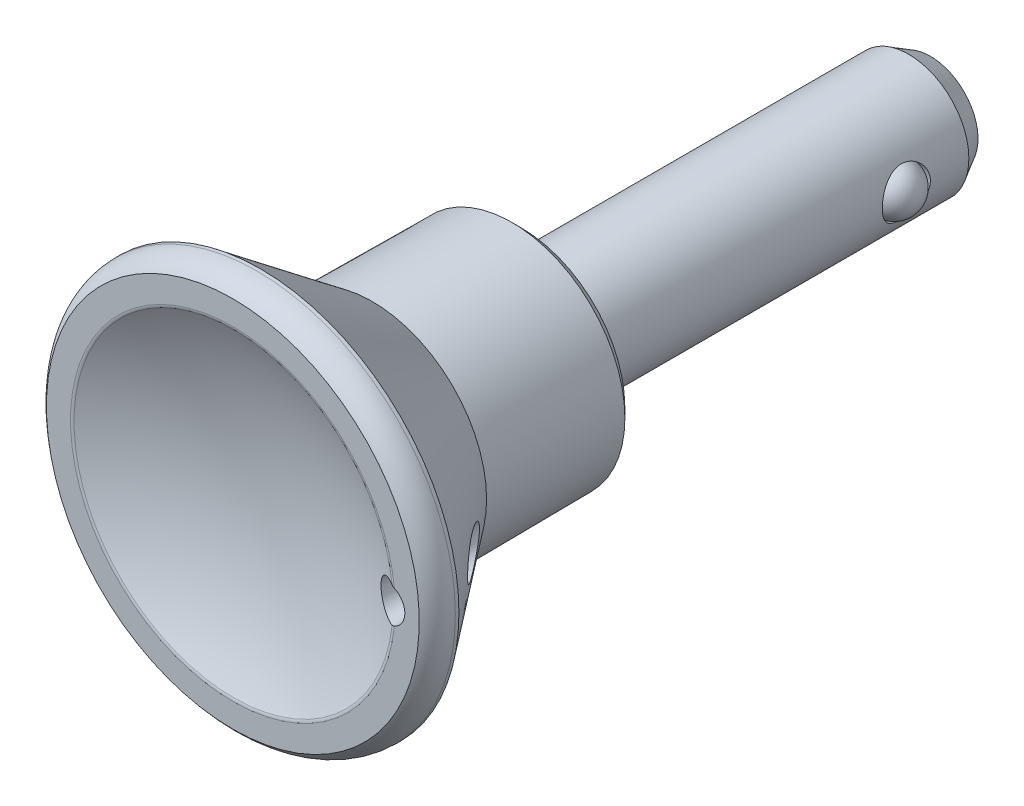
ISO-10303-21;
HEADER;
FILE_DESCRIPTION(('STEP AP214'),'2;1');
FILE_NAME('part.step','',(''),(''),'','','');
FILE_SCHEMA(('AUTOMOTIVE_DESIGN { 1 0 10303 214 1 1 1 1 }'));
ENDSEC;
DATA;
#1=APPLICATION_CONTEXT('core data for automotive mechanical design processes');
#2=APPLICATION_PROTOCOL_DEFINITION('international standard','automotive_design',2000,#1);
#3=PRODUCT_CONTEXT('',#1,'mechanical');
#4=PRODUCT('Part','Part','',(#3));
#5=PRODUCT_RELATED_PRODUCT_CATEGORY('part','',(#4));
#6=PRODUCT_DEFINITION_FORMATION('','',#4);
#7=PRODUCT_DEFINITION_CONTEXT('part definition',#1,'design');
#8=PRODUCT_DEFINITION('design','',#6,#7);
#9=PRODUCT_DEFINITION_SHAPE('','',#8);
#10=(LENGTH_UNIT() NAMED_UNIT(*) SI_UNIT(.MILLI.,.METRE.));
#11=(NAMED_UNIT(*) PLANE_ANGLE_UNIT() SI_UNIT($,.RADIAN.));
#12=(NAMED_UNIT(*) SI_UNIT($,.STERADIAN.) SOLID_ANGLE_UNIT());
#13=UNCERTAINTY_MEASURE_WITH_UNIT(LENGTH_MEASURE(1.E-05),#10,'distance_accuracy_value','');
#14=(GEOMETRIC_REPRESENTATION_CONTEXT(3) GLOBAL_UNCERTAINTY_ASSIGNED_CONTEXT((#13)) GLOBAL_UNIT_ASSIGNED_CONTEXT((#10,
#11,#12)) REPRESENTATION_CONTEXT('',''));
#15=CARTESIAN_POINT('',(0.,0.,0.));
#16=DIRECTION('',(0.,0.,1.));
#17=DIRECTION('',(1.,0.,0.));
#18=AXIS2_PLACEMENT_3D('',#15,#16,#17);
#19=CARTESIAN_POINT('',(0.,0.,23.5));
#20=DIRECTION('',(0.,0.,1.));
#21=DIRECTION('',(0.,-1.,0.));
#22=AXIS2_PLACEMENT_3D('',#19,#20,#21);
#23=TOROIDAL_SURFACE('',#22,13.499629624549,0.50000000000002);
#24=CARTESIAN_POINT('',(13.1832697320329,1.45020836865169,23.940350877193));
#25=CARTESIAN_POINT('',(13.1967898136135,1.44663630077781,23.9473693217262));
#26=CARTESIAN_POINT('',(13.2105528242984,1.44279517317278,23.9537540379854));
#27=CARTESIAN_POINT('',(13.2384329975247,1.43456873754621,23.9652617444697));
#28=CARTESIAN_POINT('',(13.2525500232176,1.43018363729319,23.9703852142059));
#29=CARTESIAN_POINT('',(13.294658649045,1.41639274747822,23.9836925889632));
#30=CARTESIAN_POINT('',(13.322980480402,1.40620303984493,23.9901034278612));
#31=CARTESIAN_POINT('',(13.3645007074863,1.38980064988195,23.9961744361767));
#32=CARTESIAN_POINT('',(13.377775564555,1.38433480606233,23.9976116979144));
#33=CARTESIAN_POINT('',(13.4043485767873,1.37294329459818,23.9995283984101));
#34=CARTESIAN_POINT('',(13.4176457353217,1.3670137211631,23.999998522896));
#35=CARTESIAN_POINT('',(13.430859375,1.3608881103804,24.));
#36=B_SPLINE_CURVE_WITH_KNOTS('',3,(#24,#25,#26,#27,#28,#29,#30,#31,#32,#33,#34,#35),
.UNSPECIFIED.,.F.,.F.,(4,2,2,2,2,4),(0.,0.0468986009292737,0.0937793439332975,0.185591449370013,
0.228845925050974,0.272515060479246),.UNSPECIFIED.);
#37=CARTESIAN_POINT('',(13.1832697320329,1.45020836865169,23.940350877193));
#38=VERTEX_POINT('',#37);
#39=CARTESIAN_POINT('',(13.430859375,1.36088811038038,24.));
#40=VERTEX_POINT('',#39);
#41=EDGE_CURVE('E57',#38,#40,#36,.T.);
#42=ORIENTED_EDGE('',*,*,#41,.T.);
#43=CARTESIAN_POINT('',(0.,0.,24.));
#44=DIRECTION('',(0.,0.,1.));
#45=DIRECTION('',(0.,-1.,0.));
#46=AXIS2_PLACEMENT_3D('',#43,#44,#45);
#47=CIRCLE('',#46,13.499629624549);
#48=CARTESIAN_POINT('',(13.430859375,-1.36088811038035,24.));
#49=VERTEX_POINT('',#48);
#50=EDGE_CURVE('E37',#49,#40,#47,.F.);
#51=ORIENTED_EDGE('',*,*,#50,.F.);
#52=CARTESIAN_POINT('',(13.430859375,-1.36088811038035,24.));
#53=CARTESIAN_POINT('',(13.4166665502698,-1.36746807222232,23.9999984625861));
#54=CARTESIAN_POINT('',(13.4023759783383,-1.37382175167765,23.9994558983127));
#55=CARTESIAN_POINT('',(13.3736641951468,-1.38605678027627,23.9972288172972));
#56=CARTESIAN_POINT('',(13.3592428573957,-1.39193760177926,23.9955430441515));
#57=CARTESIAN_POINT('',(13.316571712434,-1.4085689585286,23.9887845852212));
#58=CARTESIAN_POINT('',(13.2882736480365,-1.41860415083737,23.9820148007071));
#59=CARTESIAN_POINT('',(13.2473798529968,-1.4317969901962,23.9685266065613));
#60=CARTESIAN_POINT('',(13.2344037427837,-1.43578270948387,23.9636790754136));
#61=CARTESIAN_POINT('',(13.2086362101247,-1.44332889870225,23.9528611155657));
#62=CARTESIAN_POINT('',(13.1958479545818,-1.44688469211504,23.9468798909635));
#63=CARTESIAN_POINT('',(13.1832697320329,-1.45020836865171,23.940350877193));
#64=B_SPLINE_CURVE_WITH_KNOTS('',3,(#52,#53,#54,#55,#56,#57,#58,#59,#60,#61,#62,#63),
.UNSPECIFIED.,.F.,.F.,(4,2,2,2,2,4),(0.,0.0469051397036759,0.0938619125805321,0.185680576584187,
0.228880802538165,0.272515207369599),.UNSPECIFIED.);
#65=CARTESIAN_POINT('',(13.1832697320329,-1.4502083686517,23.940350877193));
#66=VERTEX_POINT('',#65);
#67=EDGE_CURVE('E19',#49,#66,#64,.T.);
#68=ORIENTED_EDGE('',*,*,#67,.T.);
#69=CARTESIAN_POINT('',(0.,0.,23.940350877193));
#70=DIRECTION('',(0.,0.,1.));
#71=DIRECTION('',(0.,-1.,0.));
#72=AXIS2_PLACEMENT_3D('',#69,#70,#71);
#73=CIRCLE('',#72,13.2627940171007);
#74=EDGE_CURVE('E52',#38,#66,#73,.T.);
#75=ORIENTED_EDGE('',*,*,#74,.F.);
#76=EDGE_LOOP('',(#42,#51,#68,#75));
#77=FACE_BOUND('',#76,.T.);
#78=ADVANCED_FACE('F14',(#77),#23,.T.);
#79=CARTESIAN_POINT('',(0.,0.,48.6));
#80=DIRECTION('',(0.,-1.,0.));
#81=DIRECTION('',(0.,0.,1.));
#82=AXIS2_PLACEMENT_3D('',#79,#80,#81);
#83=SPHERICAL_SURFACE('',#82,28.);
#84=CARTESIAN_POINT('',(13.1832697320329,1.45020836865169,23.940350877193));
#85=CARTESIAN_POINT('',(13.0915993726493,1.4744532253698,23.8927620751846));
#86=CARTESIAN_POINT('',(12.9980560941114,1.489860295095,23.8443501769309));
#87=CARTESIAN_POINT('',(12.8097591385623,1.50293318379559,23.7471842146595));
#88=CARTESIAN_POINT('',(12.7150040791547,1.50057651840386,23.6984297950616));
#89=CARTESIAN_POINT('',(12.5270201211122,1.47798913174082,23.6019874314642));
#90=CARTESIAN_POINT('',(12.4337919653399,1.45774995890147,23.5543000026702));
#91=CARTESIAN_POINT('',(12.2517517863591,1.39948117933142,23.4614379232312));
#92=CARTESIAN_POINT('',(12.1629377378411,1.36145981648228,23.416262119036));
#93=CARTESIAN_POINT('',(11.9952411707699,1.26934990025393,23.3311736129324));
#94=CARTESIAN_POINT('',(11.9161458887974,1.21575714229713,23.2911465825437));
#95=CARTESIAN_POINT('',(11.7681643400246,1.09295087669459,23.2164149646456));
#96=CARTESIAN_POINT('',(11.6992729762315,1.02374521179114,23.1817077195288));
#97=CARTESIAN_POINT('',(11.5811025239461,0.878735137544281,23.1222729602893));
#98=CARTESIAN_POINT('',(11.5305709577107,0.804216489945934,23.0969048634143));
#99=CARTESIAN_POINT('',(11.4431131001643,0.645771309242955,23.0530473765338));
#100=CARTESIAN_POINT('',(11.4061726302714,0.561854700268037,23.0345508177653));
#101=CARTESIAN_POINT('',(11.3518094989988,0.398913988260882,23.0073479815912));
#102=CARTESIAN_POINT('',(11.332464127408,0.32068873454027,22.9976766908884));
#103=CARTESIAN_POINT('',(11.3065630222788,0.161638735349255,22.9847305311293));
#104=CARTESIAN_POINT('',(11.3000015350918,0.0808151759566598,22.9814527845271));
#105=CARTESIAN_POINT('',(11.2999985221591,-0.0778011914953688,22.9814513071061));
#106=CARTESIAN_POINT('',(11.3060768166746,-0.155594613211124,22.9844877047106));
#107=CARTESIAN_POINT('',(11.3300927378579,-0.308850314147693,22.9964912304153));
#108=CARTESIAN_POINT('',(11.3480306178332,-0.384312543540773,23.0054584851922));
#109=CARTESIAN_POINT('',(11.3948947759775,-0.530632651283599,23.0289063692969));
#110=CARTESIAN_POINT('',(11.4237977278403,-0.601499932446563,23.0433752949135));
#111=CARTESIAN_POINT('',(11.4913996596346,-0.737094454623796,23.0772561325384));
#112=CARTESIAN_POINT('',(11.5301003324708,-0.801820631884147,23.0966688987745));
#113=CARTESIAN_POINT('',(11.6176766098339,-0.9263609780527,23.1406602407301));
#114=CARTESIAN_POINT('',(11.6669073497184,-0.985860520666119,23.1654195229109));
#115=CARTESIAN_POINT('',(11.7728262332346,-1.09578522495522,23.2187793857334));
#116=CARTESIAN_POINT('',(11.8295165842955,-1.14620769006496,23.2473811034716));
#117=CARTESIAN_POINT('',(11.9547131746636,-1.24189507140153,23.3106654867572));
#118=CARTESIAN_POINT('',(12.0238340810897,-1.28614058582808,23.3456702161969));
#119=CARTESIAN_POINT('',(12.1672246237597,-1.36242212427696,23.4184517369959));
#120=CARTESIAN_POINT('',(12.2414976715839,-1.39444996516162,23.4562303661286));
#121=CARTESIAN_POINT('',(12.3592920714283,-1.4344825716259,23.5162885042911));
#122=CARTESIAN_POINT('',(12.4017101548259,-1.44682505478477,23.5379430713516));
#123=CARTESIAN_POINT('',(12.4872184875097,-1.46768648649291,23.5816530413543));
#124=CARTESIAN_POINT('',(12.5303081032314,-1.47620883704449,23.603708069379));
#125=CARTESIAN_POINT('',(12.6602504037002,-1.49604024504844,23.6703078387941));
#126=CARTESIAN_POINT('',(12.7478240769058,-1.50162964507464,23.7153114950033));
#127=CARTESIAN_POINT('',(12.8938293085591,-1.49821627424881,23.7905484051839));
#128=CARTESIAN_POINT('',(12.9524047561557,-1.49339577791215,23.8207882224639));
#129=CARTESIAN_POINT('',(13.0686394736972,-1.47691090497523,23.8809033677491));
#130=CARTESIAN_POINT('',(13.1263001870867,-1.46525870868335,23.9107792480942));
#131=CARTESIAN_POINT('',(13.1832697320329,-1.4502083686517,23.9403508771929));
#132=B_SPLINE_CURVE_WITH_KNOTS('',3,(#84,#85,#86,#87,#88,#89,#90,#91,#92,#93,#94,#95,#96,#97,
#98,#99,#100,#101,#102,#103,#104,#105,#106,#107,#108,#109,#110,#111,#112,#113,#114,#115,#116,
#117,#118,#119,#120,#121,#122,#123,#124,#125,#126,#127,#128,#129,#130,#131),.UNSPECIFIED.,.F.,
.F.,(4,2,2,2,2,2,2,2,2,2,2,2,2,2,2,2,2,2,2,2,2,2,2,4),(0.,0.317865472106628,0.636133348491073,
0.954551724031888,1.27282262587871,1.58190076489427,1.89082399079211,2.16986616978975,
2.44861641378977,2.69085568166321,2.93298589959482,3.16608592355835,3.39919092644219,
3.63180279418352,3.8644548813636,4.10674626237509,4.34910950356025,4.61569988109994,
4.88246850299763,5.02992533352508,5.17725058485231,5.4717357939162,5.66970066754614,
5.86731365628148),.UNSPECIFIED.);
#133=EDGE_CURVE('E48',#38,#66,#132,.T.);
#134=ORIENTED_EDGE('',*,*,#133,.F.);
#135=ORIENTED_EDGE('',*,*,#74,.T.);
#136=EDGE_LOOP('',(#134,#135));
#137=FACE_BOUND('',#136,.T.);
#138=ADVANCED_FACE('F50',(#137),#83,.F.);
#139=CARTESIAN_POINT('',(-15.81,-15.5,24.));
#140=CARTESIAN_POINT('',(-15.5,-15.5,24.));
#141=CARTESIAN_POINT('',(15.5,-15.5,24.));
#142=B_SPLINE_CURVE_WITH_KNOTS('',1,(#139,#140,#141),.UNSPECIFIED.,.F.,.F.,(2,1,2),(-0.01,0.,
1.),.UNSPECIFIED.);
#143=DIRECTION('',(0.,1.,0.));
#144=VECTOR('',#143,1.);
#145=SURFACE_OF_LINEAR_EXTRUSION('',#142,#144);
#146=CARTESIAN_POINT('',(12.8,0.,24.));
#147=DIRECTION('',(0.,0.,1.));
#148=DIRECTION('',(0.,-1.,0.));
#149=AXIS2_PLACEMENT_3D('',#146,#147,#148);
#150=CIRCLE('',#149,1.5);
#151=EDGE_CURVE('E54',#49,#40,#150,.T.);
#152=ORIENTED_EDGE('',*,*,#151,.F.);
#153=ORIENTED_EDGE('',*,*,#50,.T.);
#154=EDGE_LOOP('',(#152,#153));
#155=FACE_BOUND('',#154,.T.);
#156=CARTESIAN_POINT('',(0.,0.,24.));
#157=DIRECTION('',(0.,0.,1.));
#158=DIRECTION('',(0.,-1.,0.));
#159=AXIS2_PLACEMENT_3D('',#156,#157,#158);
#160=CIRCLE('',#159,15.5);
#161=CARTESIAN_POINT('',(0.,-15.5,24.));
#162=VERTEX_POINT('',#161);
#163=EDGE_CURVE('E55',#162,#162,#160,.F.);
#164=ORIENTED_EDGE('',*,*,#163,.F.);
#165=EDGE_LOOP('',(#164));
#166=FACE_BOUND('',#165,.T.);
#167=ADVANCED_FACE('F144',(#155,#166),#145,.T.);
#168=CARTESIAN_POINT('',(0.,0.,22.));
#169=DIRECTION('',(0.,0.,1.));
#170=DIRECTION('',(0.,-1.,0.));
#171=AXIS2_PLACEMENT_3D('',#168,#169,#170);
#172=TOROIDAL_SURFACE('',#171,14.,2.5);
#173=ORIENTED_EDGE('',*,*,#163,.T.);
#174=EDGE_LOOP('',(#173));
#175=FACE_BOUND('',#174,.T.);
#176=CARTESIAN_POINT('',(0.,0.,22.));
#177=DIRECTION('',(0.,0.,1.));
#178=DIRECTION('',(1.,0.,0.));
#179=AXIS2_PLACEMENT_3D('',#176,#177,#178);
#180=CIRCLE('',#179,16.5);
#181=CARTESIAN_POINT('',(16.5,0.,22.));
#182=VERTEX_POINT('',#181);
#183=EDGE_CURVE('E93',#182,#182,#180,.F.);
#184=ORIENTED_EDGE('',*,*,#183,.F.);
#185=EDGE_LOOP('',(#184));
#186=FACE_BOUND('',#185,.T.);
#187=ADVANCED_FACE('F72',(#175,#186),#172,.T.);
#188=CARTESIAN_POINT('',(12.8,0.,14.7910576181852));
#189=DIRECTION('',(0.,0.,1.));
#190=DIRECTION('',(0.,-1.,0.));
#191=AXIS2_PLACEMENT_3D('',#188,#189,#190);
#192=CYLINDRICAL_SURFACE('',#191,1.5);
#193=CARTESIAN_POINT('',(12.62421875,-1.48966471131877,16.6671130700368));
#194=CARTESIAN_POINT('',(12.6920032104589,-1.49766166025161,16.7577945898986));
#195=CARTESIAN_POINT('',(12.7603283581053,-1.50104579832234,16.8484671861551));
#196=CARTESIAN_POINT('',(12.897645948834,-1.49839397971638,17.0292601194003));
#197=CARTESIAN_POINT('',(12.9666387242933,-1.49235306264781,17.1193801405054));
#198=CARTESIAN_POINT('',(13.1046564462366,-1.47039580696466,17.2982798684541));
#199=CARTESIAN_POINT('',(13.1736813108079,-1.45448817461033,17.3870606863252));
#200=CARTESIAN_POINT('',(13.3110827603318,-1.41207641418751,17.5624849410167));
#201=CARTESIAN_POINT('',(13.3794598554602,-1.38558148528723,17.6491301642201));
#202=CARTESIAN_POINT('',(13.5187485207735,-1.31898430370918,17.8243946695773));
#203=CARTESIAN_POINT('',(13.5895656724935,-1.27816038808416,17.9128199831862));
#204=CARTESIAN_POINT('',(13.7277317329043,-1.18169522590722,18.084148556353));
#205=CARTESIAN_POINT('',(13.7950853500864,-1.12607476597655,18.1670593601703));
#206=CARTESIAN_POINT('',(13.9084086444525,-1.01303116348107,18.3057043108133));
#207=CARTESIAN_POINT('',(13.9556726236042,-0.959133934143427,18.3632332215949));
#208=CARTESIAN_POINT('',(14.0446143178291,-0.840483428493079,18.471045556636));
#209=CARTESIAN_POINT('',(14.0863013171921,-0.775748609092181,18.5213410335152));
#210=CARTESIAN_POINT('',(14.1507925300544,-0.65471783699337,18.5988956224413));
#211=CARTESIAN_POINT('',(14.1756178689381,-0.601120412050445,18.6286642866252));
#212=CARTESIAN_POINT('',(14.2195452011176,-0.488403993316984,18.6812412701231));
#213=CARTESIAN_POINT('',(14.238652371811,-0.429290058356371,18.7040558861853));
#214=CARTESIAN_POINT('',(14.2689681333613,-0.309460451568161,18.7402118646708));
#215=CARTESIAN_POINT('',(14.2805052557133,-0.248950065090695,18.7539474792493));
#216=CARTESIAN_POINT('',(14.2960184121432,-0.12562551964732,18.77240966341));
#217=CARTESIAN_POINT('',(14.3000000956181,-0.0628131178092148,18.7771429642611));
#218=CARTESIAN_POINT('',(14.2999999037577,0.0632231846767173,18.7771427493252));
#219=CARTESIAN_POINT('',(14.2959658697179,0.126447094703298,18.7723472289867));
#220=CARTESIAN_POINT('',(14.2802519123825,0.250551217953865,18.7536458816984));
#221=CARTESIAN_POINT('',(14.2685662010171,0.311429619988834,18.7397331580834));
#222=CARTESIAN_POINT('',(14.2387365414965,0.428564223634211,18.7041556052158));
#223=CARTESIAN_POINT('',(14.2206451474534,0.484853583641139,18.6825538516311));
#224=CARTESIAN_POINT('',(14.1792492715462,0.592453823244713,18.633014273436));
#225=CARTESIAN_POINT('',(14.1559422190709,0.643762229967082,18.6050733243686));
#226=CARTESIAN_POINT('',(14.0931329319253,0.764461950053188,18.5295741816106));
#227=CARTESIAN_POINT('',(14.0512237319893,0.830727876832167,18.4790335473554));
#228=CARTESIAN_POINT('',(13.9615408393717,0.952125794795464,18.370367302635));
#229=CARTESIAN_POINT('',(13.9137529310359,1.00722990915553,18.3122232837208));
#230=CARTESIAN_POINT('',(13.7883270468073,1.13348006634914,18.1588182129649));
#231=CARTESIAN_POINT('',(13.708179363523,1.1978805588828,18.0600849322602));
#232=CARTESIAN_POINT('',(13.5435609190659,1.3064664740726,17.8554996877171));
#233=CARTESIAN_POINT('',(13.4590828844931,1.35061655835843,17.7496356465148));
#234=CARTESIAN_POINT('',(13.3107013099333,1.41202717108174,17.5619635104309));
#235=CARTESIAN_POINT('',(13.2471965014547,1.43330058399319,17.4811068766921));
#236=CARTESIAN_POINT('',(13.1198264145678,1.46698834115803,17.3177942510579));
#237=CARTESIAN_POINT('',(13.0559609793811,1.47939847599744,17.2353375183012));
#238=CARTESIAN_POINT('',(12.9282718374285,1.49589397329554,17.0692879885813));
#239=CARTESIAN_POINT('',(12.8644485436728,1.49996064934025,16.9856930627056));
#240=CARTESIAN_POINT('',(12.7374091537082,1.5000387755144,16.8180712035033));
#241=CARTESIAN_POINT('',(12.6741929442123,1.49605175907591,16.7340443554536));
#242=CARTESIAN_POINT('',(12.5469978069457,1.47993658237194,16.5637117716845));
#243=CARTESIAN_POINT('',(12.4830456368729,1.46758777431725,16.4774068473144));
#244=CARTESIAN_POINT('',(12.3565302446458,1.43443826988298,16.3053467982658));
#245=CARTESIAN_POINT('',(12.2939675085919,1.41363466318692,16.2195918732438));
#246=CARTESIAN_POINT('',(12.1709555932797,1.36334219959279,16.0496685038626));
#247=CARTESIAN_POINT('',(12.1104987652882,1.33388949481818,15.9654949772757));
#248=CARTESIAN_POINT('',(11.9920388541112,1.26565016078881,15.7992974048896));
#249=CARTESIAN_POINT('',(11.9340336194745,1.22687192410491,15.7172714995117));
#250=CARTESIAN_POINT('',(11.8266654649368,1.14315320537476,15.5643050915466));
#251=CARTESIAN_POINT('',(11.7770073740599,1.09916121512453,15.4930561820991));
#252=CARTESIAN_POINT('',(11.6811267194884,1.0014126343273,15.3545942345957));
#253=CARTESIAN_POINT('',(11.6349116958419,0.947635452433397,15.2873901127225));
#254=CARTESIAN_POINT('',(11.5691423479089,0.858125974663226,15.1911821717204));
#255=CARTESIAN_POINT('',(11.5476572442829,0.826531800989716,15.1596504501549));
#256=CARTESIAN_POINT('',(11.5063433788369,0.760253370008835,15.0988444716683));
#257=CARTESIAN_POINT('',(11.4865152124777,0.725568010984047,15.0695710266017));
#258=CARTESIAN_POINT('',(11.4302732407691,0.616814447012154,14.9863165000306));
#259=CARTESIAN_POINT('',(11.3967954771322,0.537651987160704,14.9364517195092));
#260=CARTESIAN_POINT('',(11.3555291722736,0.407099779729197,14.8747804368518));
#261=CARTESIAN_POINT('',(11.3430899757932,0.360365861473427,14.856144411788));
#262=CARTESIAN_POINT('',(11.3225831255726,0.263914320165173,14.8253840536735));
#263=CARTESIAN_POINT('',(11.3145046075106,0.214204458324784,14.8132435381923));
#264=CARTESIAN_POINT('',(11.3059949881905,0.136701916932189,14.8004485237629));
#265=CARTESIAN_POINT('',(11.3037543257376,0.109528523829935,14.7970776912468));
#266=CARTESIAN_POINT('',(11.300755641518,0.0549082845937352,14.7925658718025));
#267=CARTESIAN_POINT('',(11.2999979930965,0.0274613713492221,14.791425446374));
#268=CARTESIAN_POINT('',(11.3000036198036,-0.0495314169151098,14.7914342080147));
#269=CARTESIAN_POINT('',(11.3024785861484,-0.0991098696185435,14.7951600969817));
#270=CARTESIAN_POINT('',(11.3121472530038,-0.196763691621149,14.8096998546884));
#271=CARTESIAN_POINT('',(11.3193489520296,-0.244836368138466,14.8205257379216));
#272=CARTESIAN_POINT('',(11.3399096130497,-0.348584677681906,14.851379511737));
#273=CARTESIAN_POINT('',(11.3542736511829,-0.403610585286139,14.8729064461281));
#274=CARTESIAN_POINT('',(11.387815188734,-0.50871821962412,14.9230284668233));
#275=CARTESIAN_POINT('',(11.4070004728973,-0.558791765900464,14.9516349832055));
#276=CARTESIAN_POINT('',(11.4595328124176,-0.677671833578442,15.0296959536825));
#277=CARTESIAN_POINT('',(11.4951602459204,-0.74330038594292,15.0824162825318));
#278=CARTESIAN_POINT('',(11.5718624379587,-0.864190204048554,15.1952386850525));
#279=CARTESIAN_POINT('',(11.6129512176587,-0.919423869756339,15.2553597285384));
#280=CARTESIAN_POINT('',(11.6921657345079,-1.01283475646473,15.3705343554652));
#281=CARTESIAN_POINT('',(11.7297508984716,-1.05232856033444,15.4249113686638));
#282=CARTESIAN_POINT('',(11.8070065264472,-1.12552131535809,15.5360737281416));
#283=CARTESIAN_POINT('',(11.8466784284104,-1.15921620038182,15.5928607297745));
#284=CARTESIAN_POINT('',(11.9276586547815,-1.22132048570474,15.7081342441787));
#285=CARTESIAN_POINT('',(11.9689673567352,-1.24972865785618,15.7666211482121));
#286=CARTESIAN_POINT('',(12.0529136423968,-1.30165144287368,15.884812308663));
#287=CARTESIAN_POINT('',(12.0955516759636,-1.32516437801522,15.9445169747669));
#288=CARTESIAN_POINT('',(12.2167649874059,-1.38470455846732,16.1132939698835));
#289=CARTESIAN_POINT('',(12.2965837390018,-1.41552588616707,16.2233378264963));
#290=CARTESIAN_POINT('',(12.458735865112,-1.46310486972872,16.4446295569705));
#291=CARTESIAN_POINT('',(12.5410705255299,-1.47985520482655,16.5558780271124));
#292=CARTESIAN_POINT('',(12.62421875,-1.48966471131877,16.6671130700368));
#293=B_SPLINE_CURVE_WITH_KNOTS('',3,(#193,#194,#195,#196,#197,#198,#199,#200,#201,#202,#203,
#204,#205,#206,#207,#208,#209,#210,#211,#212,#213,#214,#215,#216,#217,#218,#219,#220,#221,#222,
#223,#224,#225,#226,#227,#228,#229,#230,#231,#232,#233,#234,#235,#236,#237,#238,#239,#240,#241,
#242,#243,#244,#245,#246,#247,#248,#249,#250,#251,#252,#253,#254,#255,#256,#257,#258,#259,#260,
#261,#262,#263,#264,#265,#266,#267,#268,#269,#270,#271,#272,#273,#274,#275,#276,#277,#278,#279,
#280,#281,#282,#283,#284,#285,#286,#287,#288,#289,#290,#291,#292),.UNSPECIFIED.,.T.,.F.,(4,2,2,
2,2,2,2,2,2,2,2,2,2,2,2,2,2,2,2,2,2,2,2,2,2,2,2,2,2,2,2,2,2,2,2,2,2,2,2,2,2,2,2,2,2,2,2,2,2,4),
(0.,0.3403810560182,0.680941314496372,1.02120149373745,1.36116666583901,1.72154948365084,
2.08142867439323,2.35634247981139,2.63079277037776,2.82853330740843,3.02609425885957,
3.21438583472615,3.40253656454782,3.59191561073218,3.78143807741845,3.96944036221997,
4.15753551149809,4.43581804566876,4.71478725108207,5.14007838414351,5.56610888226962,
5.88069336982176,6.19542716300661,6.51086508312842,6.82624294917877,7.15028500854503,
7.47443870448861,7.79725631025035,8.11978447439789,8.41136093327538,8.70355821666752,
8.8520054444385,9.00050579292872,9.29551066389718,9.45047012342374,9.60504170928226,
9.6873437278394,9.76966646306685,9.91815000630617,10.0668854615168,10.2482950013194,
10.4299993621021,10.702706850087,10.9761285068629,11.2068168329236,11.4376662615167,
11.6685692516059,11.8995512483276,12.3168647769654,12.7343952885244),.UNSPECIFIED.);
#294=CARTESIAN_POINT('',(12.62421875,-1.48966471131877,16.6671130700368));
#295=VERTEX_POINT('',#294);
#296=EDGE_CURVE('E86',#295,#295,#293,.T.);
#297=ORIENTED_EDGE('',*,*,#296,.F.);
#298=EDGE_LOOP('',(#297));
#299=FACE_BOUND('',#298,.T.);
#300=ORIENTED_EDGE('',*,*,#67,.F.);
#301=ORIENTED_EDGE('',*,*,#151,.T.);
#302=ORIENTED_EDGE('',*,*,#41,.F.);
#303=ORIENTED_EDGE('',*,*,#133,.T.);
#304=EDGE_LOOP('',(#300,#301,#302,#303));
#305=FACE_BOUND('',#304,.T.);
#306=ADVANCED_FACE('F58',(#299,#305),#192,.F.);
#307=CARTESIAN_POINT('',(0.,0.,22.));
#308=DIRECTION('',(0.,0.,1.));
#309=DIRECTION('',(0.,-1.,0.));
#310=AXIS2_PLACEMENT_3D('',#307,#308,#309);
#311=CYLINDRICAL_SURFACE('',#310,16.5);
#312=ORIENTED_EDGE('',*,*,#183,.T.);
#313=EDGE_LOOP('',(#312));
#314=FACE_BOUND('',#313,.T.);
#315=CARTESIAN_POINT('',(0.,0.,21.7));
#316=DIRECTION('',(0.,0.,-1.));
#317=DIRECTION('',(1.,0.,0.));
#318=AXIS2_PLACEMENT_3D('',#315,#316,#317);
#319=CIRCLE('',#318,16.5);
#320=CARTESIAN_POINT('',(16.5,0.,21.7));
#321=VERTEX_POINT('',#320);
#322=EDGE_CURVE('E92',#321,#321,#319,.T.);
#323=ORIENTED_EDGE('',*,*,#322,.F.);
#324=EDGE_LOOP('',(#323));
#325=FACE_BOUND('',#324,.T.);
#326=ADVANCED_FACE('F71',(#314,#325),#311,.T.);
#327=CARTESIAN_POINT('',(0.,0.,12.4));
#328=DIRECTION('',(0.,0.,1.));
#329=DIRECTION('',(0.,-1.,0.));
#330=AXIS2_PLACEMENT_3D('',#327,#328,#329);
#331=CONICAL_SURFACE('',#330,9.5,0.645219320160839);
#332=ORIENTED_EDGE('',*,*,#296,.T.);
#333=EDGE_LOOP('',(#332));
#334=FACE_BOUND('',#333,.T.);
#335=ORIENTED_EDGE('',*,*,#322,.T.);
#336=EDGE_LOOP('',(#335));
#337=FACE_BOUND('',#336,.T.);
#338=CARTESIAN_POINT('',(0.,0.,12.4));
#339=DIRECTION('',(0.,0.,-1.));
#340=DIRECTION('',(1.,0.,0.));
#341=AXIS2_PLACEMENT_3D('',#338,#339,#340);
#342=CIRCLE('',#341,9.5);
#343=CARTESIAN_POINT('',(9.5,0.,12.4));
#344=VERTEX_POINT('',#343);
#345=EDGE_CURVE('E128',#344,#344,#342,.T.);
#346=ORIENTED_EDGE('',*,*,#345,.F.);
#347=EDGE_LOOP('',(#346));
#348=FACE_BOUND('',#347,.T.);
#349=ADVANCED_FACE('F96',(#334,#337,#348),#331,.T.);
#350=CARTESIAN_POINT('',(0.,0.,0.799969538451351));
#351=DIRECTION('',(0.,0.,1.));
#352=DIRECTION('',(0.,-1.,0.));
#353=AXIS2_PLACEMENT_3D('',#350,#351,#352);
#354=CONICAL_SURFACE('',#353,9.39876806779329,0.00872664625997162);
#355=ORIENTED_EDGE('',*,*,#345,.T.);
#356=EDGE_LOOP('',(#355));
#357=FACE_BOUND('',#356,.T.);
#358=CARTESIAN_POINT('',(0.,0.,0.799969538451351));
#359=DIRECTION('',(0.,0.,-1.));
#360=DIRECTION('',(1.,0.,0.));
#361=AXIS2_PLACEMENT_3D('',#358,#359,#360);
#362=CIRCLE('',#361,9.39876806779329);
#363=CARTESIAN_POINT('',(9.39876806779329,0.,0.799969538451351));
#364=VERTEX_POINT('',#363);
#365=EDGE_CURVE('E125',#364,#364,#362,.T.);
#366=ORIENTED_EDGE('',*,*,#365,.F.);
#367=EDGE_LOOP('',(#366));
#368=FACE_BOUND('',#367,.T.);
#369=ADVANCED_FACE('F100',(#357,#368),#354,.T.);
#370=CARTESIAN_POINT('',(3.96076951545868,-4.00830085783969,-34.));
#371=DIRECTION('',(0.,0.,-1.));
#372=DIRECTION('',(-1.,0.,0.));
#373=AXIS2_PLACEMENT_3D('',#370,#371,#372);
#374=PLANE('',#373);
#375=CARTESIAN_POINT('',(0.,0.,-34.));
#376=DIRECTION('',(0.,0.,1.));
#377=DIRECTION('',(0.,-1.,0.));
#378=AXIS2_PLACEMENT_3D('',#375,#376,#377);
#379=CIRCLE('',#378,3.96076951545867);
#380=CARTESIAN_POINT('',(0.,-3.96076951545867,-34.));
#381=VERTEX_POINT('',#380);
#382=EDGE_CURVE('E94',#381,#381,#379,.T.);
#383=ORIENTED_EDGE('',*,*,#382,.F.);
#384=EDGE_LOOP('',(#383));
#385=FACE_BOUND('',#384,.T.);
#386=ADVANCED_FACE('F104',(#385),#374,.T.);
#387=CARTESIAN_POINT('',(0.,0.,0.));
#388=DIRECTION('',(0.,0.,1.));
#389=DIRECTION('',(0.,-1.,0.));
#390=AXIS2_PLACEMENT_3D('',#387,#388,#389);
#391=CONICAL_SURFACE('',#390,8.59178683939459,0.789761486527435);
#392=ORIENTED_EDGE('',*,*,#365,.T.);
#393=EDGE_LOOP('',(#392));
#394=FACE_BOUND('',#393,.T.);
#395=CARTESIAN_POINT('',(0.,0.,0.));
#396=DIRECTION('',(0.,0.,1.));
#397=DIRECTION('',(0.,-1.,0.));
#398=AXIS2_PLACEMENT_3D('',#395,#396,#397);
#399=CIRCLE('',#398,8.59178683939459);
#400=CARTESIAN_POINT('',(0.,-8.59178683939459,0.));
#401=VERTEX_POINT('',#400);
#402=EDGE_CURVE('E200',#401,#401,#399,.F.);
#403=ORIENTED_EDGE('',*,*,#402,.F.);
#404=EDGE_LOOP('',(#403));
#405=FACE_BOUND('',#404,.T.);
#406=ADVANCED_FACE('F108',(#394,#405),#391,.T.);
#407=CARTESIAN_POINT('',(3.99,0.,-27.));
#408=DIRECTION('',(0.,-1.,0.));
#409=DIRECTION('',(0.,0.,-1.));
#410=AXIS2_PLACEMENT_3D('',#407,#408,#409);
#411=SPHERICAL_SURFACE('',#410,2.01);
#412=CARTESIAN_POINT('',(4.19024984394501,0.,-27.));
#413=DIRECTION('',(1.,0.,0.));
#414=DIRECTION('',(0.,-1.,0.));
#415=AXIS2_PLACEMENT_3D('',#412,#413,#414);
#416=CIRCLE('',#415,2.);
#417=CARTESIAN_POINT('',(4.19024984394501,-2.,-27.));
#418=VERTEX_POINT('',#417);
#419=EDGE_CURVE('E202',#418,#418,#416,.F.);
#420=ORIENTED_EDGE('',*,*,#419,.F.);
#421=EDGE_LOOP('',(#420));
#422=FACE_BOUND('',#421,.T.);
#423=ADVANCED_FACE('F112',(#422),#411,.T.);
#424=CARTESIAN_POINT('',(0.,0.,-34.));
#425=DIRECTION('',(0.,0.,1.));
#426=DIRECTION('',(0.,-1.,0.));
#427=AXIS2_PLACEMENT_3D('',#424,#425,#426);
#428=CONICAL_SURFACE('',#427,3.96076951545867,0.5235987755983);
#429=ORIENTED_EDGE('',*,*,#382,.T.);
#430=EDGE_LOOP('',(#429));
#431=FACE_BOUND('',#430,.T.);
#432=CARTESIAN_POINT('',(0.,0.,-32.2));
#433=DIRECTION('',(0.,0.,1.));
#434=DIRECTION('',(1.,0.,0.));
#435=AXIS2_PLACEMENT_3D('',#432,#433,#434);
#436=CIRCLE('',#435,5.);
#437=CARTESIAN_POINT('',(5.,0.,-32.2));
#438=VERTEX_POINT('',#437);
#439=EDGE_CURVE('E123',#438,#438,#436,.T.);
#440=ORIENTED_EDGE('',*,*,#439,.F.);
#441=EDGE_LOOP('',(#440));
#442=FACE_BOUND('',#441,.T.);
#443=ADVANCED_FACE('F117',(#431,#442),#428,.T.);
#444=CARTESIAN_POINT('',(8.5917868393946,-8.69489038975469,0.));
#445=DIRECTION('',(0.,0.,-1.));
#446=DIRECTION('',(-1.,0.,0.));
#447=AXIS2_PLACEMENT_3D('',#444,#445,#446);
#448=PLANE('',#447);
#449=CARTESIAN_POINT('',(0.,0.,0.));
#450=DIRECTION('',(0.,0.,1.));
#451=DIRECTION('',(0.,-1.,0.));
#452=AXIS2_PLACEMENT_3D('',#449,#450,#451);
#453=CIRCLE('',#452,5.);
#454=CARTESIAN_POINT('',(0.,-5.,0.));
#455=VERTEX_POINT('',#454);
#456=EDGE_CURVE('E182',#455,#455,#453,.F.);
#457=ORIENTED_EDGE('',*,*,#456,.F.);
#458=EDGE_LOOP('',(#457));
#459=FACE_BOUND('',#458,.T.);
#460=ORIENTED_EDGE('',*,*,#402,.T.);
#461=EDGE_LOOP('',(#460));
#462=FACE_BOUND('',#461,.T.);
#463=ADVANCED_FACE('F187',(#459,#462),#448,.T.);
#464=CARTESIAN_POINT('',(4.19024984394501,0.,-27.));
#465=DIRECTION('',(1.,0.,0.));
#466=DIRECTION('',(0.,-1.,0.));
#467=AXIS2_PLACEMENT_3D('',#464,#465,#466);
#468=CYLINDRICAL_SURFACE('',#467,2.);
#469=ORIENTED_EDGE('',*,*,#419,.T.);
#470=EDGE_LOOP('',(#469));
#471=FACE_BOUND('',#470,.T.);
#472=CARTESIAN_POINT('',(5.,0.,-25.));
#473=CARTESIAN_POINT('',(4.99999504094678,0.107615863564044,-25.0000062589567));
#474=CARTESIAN_POINT('',(4.99648897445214,0.215325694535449,-25.0087281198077));
#475=CARTESIAN_POINT('',(4.98282088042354,0.427616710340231,-25.0432818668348));
#476=CARTESIAN_POINT('',(4.97264930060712,0.532193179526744,-25.0691383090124));
#477=CARTESIAN_POINT('',(4.94674442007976,0.734940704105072,-25.1368701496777));
#478=CARTESIAN_POINT('',(4.93102668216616,0.833128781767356,-25.1787007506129));
#479=CARTESIAN_POINT('',(4.89557266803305,1.02104090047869,-25.2770003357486));
#480=CARTESIAN_POINT('',(4.87583644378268,1.11076505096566,-25.3334691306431));
#481=CARTESIAN_POINT('',(4.83330802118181,1.28350477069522,-25.4622380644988));
#482=CARTESIAN_POINT('',(4.8104211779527,1.36606882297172,-25.5351123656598));
#483=CARTESIAN_POINT('',(4.76460397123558,1.51818036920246,-25.6934066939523));
#484=CARTESIAN_POINT('',(4.74167359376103,1.58772251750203,-25.7788318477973));
#485=CARTESIAN_POINT('',(4.69722807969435,1.714874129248,-25.9644273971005));
#486=CARTESIAN_POINT('',(4.67582146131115,1.77181418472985,-26.0650850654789));
#487=CARTESIAN_POINT('',(4.63833669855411,1.86775416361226,-26.2755348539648));
#488=CARTESIAN_POINT('',(4.62225609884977,1.90676235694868,-26.3853227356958));
#489=CARTESIAN_POINT('',(4.59826357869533,1.96389881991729,-26.6057123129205));
#490=CARTESIAN_POINT('',(4.59001420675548,1.98289395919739,-26.7160511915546));
#491=CARTESIAN_POINT('',(4.58164004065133,2.00217296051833,-26.9386349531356));
#492=CARTESIAN_POINT('',(4.5815112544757,2.00246601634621,-27.0508788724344));
#493=CARTESIAN_POINT('',(4.58910500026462,1.98498937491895,-27.2657566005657));
#494=CARTESIAN_POINT('',(4.59628174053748,1.96847534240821,-27.3685155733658));
#495=CARTESIAN_POINT('',(4.61676185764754,1.91994691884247,-27.5696594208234));
#496=CARTESIAN_POINT('',(4.63006631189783,1.88792980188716,-27.6680435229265));
#497=CARTESIAN_POINT('',(4.66159517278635,1.80869394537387,-27.8600197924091));
#498=CARTESIAN_POINT('',(4.67991453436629,1.76117802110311,-27.9534730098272));
#499=CARTESIAN_POINT('',(4.71938201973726,1.65250390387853,-28.1314192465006));
#500=CARTESIAN_POINT('',(4.74053109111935,1.59134113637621,-28.2159092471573));
#501=CARTESIAN_POINT('',(4.78526406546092,1.45156124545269,-28.3803975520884));
#502=CARTESIAN_POINT('',(4.80890991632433,1.37196139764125,-28.4595460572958));
#503=CARTESIAN_POINT('',(4.8545919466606,1.20033946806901,-28.6036660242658));
#504=CARTESIAN_POINT('',(4.87662734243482,1.10831139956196,-28.6686306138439));
#505=CARTESIAN_POINT('',(4.91716230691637,0.912007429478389,-28.7836609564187));
#506=CARTESIAN_POINT('',(4.93558065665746,0.807520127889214,-28.8333960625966));
#507=CARTESIAN_POINT('',(4.96616672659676,0.590835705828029,-28.9142166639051));
#508=CARTESIAN_POINT('',(4.97834697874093,0.478654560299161,-28.9453395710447));
#509=CARTESIAN_POINT('',(4.99108567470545,0.304486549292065,-28.9776312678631));
#510=CARTESIAN_POINT('',(4.99441629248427,0.243952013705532,-28.9860060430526));
#511=CARTESIAN_POINT('',(4.99887485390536,0.122288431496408,-28.9971921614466));
#512=CARTESIAN_POINT('',(5.00000281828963,0.061159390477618,-29.0000035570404));
#513=CARTESIAN_POINT('',(4.99999504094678,-0.107615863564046,-28.9999937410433));
#514=CARTESIAN_POINT('',(4.99648897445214,-0.215325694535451,-28.9912718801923));
#515=CARTESIAN_POINT('',(4.98282088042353,-0.427616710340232,-28.9567181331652));
#516=CARTESIAN_POINT('',(4.97264930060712,-0.532193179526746,-28.9308616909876));
#517=CARTESIAN_POINT('',(4.94674442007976,-0.734940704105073,-28.8631298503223));
#518=CARTESIAN_POINT('',(4.93102668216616,-0.833128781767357,-28.8212992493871));
#519=CARTESIAN_POINT('',(4.89557266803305,-1.02104090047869,-28.7229996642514));
#520=CARTESIAN_POINT('',(4.87583644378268,-1.11076505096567,-28.6665308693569));
#521=CARTESIAN_POINT('',(4.83330802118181,-1.28350477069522,-28.5377619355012));
#522=CARTESIAN_POINT('',(4.8104211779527,-1.36606882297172,-28.4648876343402));
#523=CARTESIAN_POINT('',(4.76460397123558,-1.51818036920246,-28.3065933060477));
#524=CARTESIAN_POINT('',(4.74167359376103,-1.58772251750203,-28.2211681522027));
#525=CARTESIAN_POINT('',(4.69722807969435,-1.714874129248,-28.0355726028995));
#526=CARTESIAN_POINT('',(4.67582146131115,-1.77181418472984,-27.9349149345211));
#527=CARTESIAN_POINT('',(4.63833669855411,-1.86775416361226,-27.7244651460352));
#528=CARTESIAN_POINT('',(4.62225609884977,-1.90676235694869,-27.6146772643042));
#529=CARTESIAN_POINT('',(4.59826357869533,-1.9638988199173,-27.3942876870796));
#530=CARTESIAN_POINT('',(4.59001420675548,-1.98289395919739,-27.2839488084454));
#531=CARTESIAN_POINT('',(4.58164004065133,-2.00217296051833,-27.0613650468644));
#532=CARTESIAN_POINT('',(4.5815112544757,-2.00246601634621,-26.9491211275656));
#533=CARTESIAN_POINT('',(4.58910500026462,-1.98498937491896,-26.7342433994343));
#534=CARTESIAN_POINT('',(4.59628174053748,-1.96847534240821,-26.6314844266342));
#535=CARTESIAN_POINT('',(4.61676185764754,-1.91994691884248,-26.4303405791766));
#536=CARTESIAN_POINT('',(4.63006631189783,-1.88792980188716,-26.3319564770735));
#537=CARTESIAN_POINT('',(4.66159517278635,-1.80869394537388,-26.1399802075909));
#538=CARTESIAN_POINT('',(4.67991453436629,-1.76117802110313,-26.0465269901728));
#539=CARTESIAN_POINT('',(4.71938201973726,-1.65250390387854,-25.8685807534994));
#540=CARTESIAN_POINT('',(4.74053109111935,-1.5913411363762,-25.7840907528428));
#541=CARTESIAN_POINT('',(4.78526406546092,-1.45156124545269,-25.6196024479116));
#542=CARTESIAN_POINT('',(4.80890991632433,-1.37196139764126,-25.5404539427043));
#543=CARTESIAN_POINT('',(4.8545919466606,-1.20033946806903,-25.3963339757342));
#544=CARTESIAN_POINT('',(4.87662734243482,-1.10831139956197,-25.3313693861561));
#545=CARTESIAN_POINT('',(4.91716230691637,-0.912007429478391,-25.2163390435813));
#546=CARTESIAN_POINT('',(4.93558065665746,-0.807520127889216,-25.1666039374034));
#547=CARTESIAN_POINT('',(4.96616672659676,-0.59083570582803,-25.0857833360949));
#548=CARTESIAN_POINT('',(4.97834697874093,-0.478654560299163,-25.0546604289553));
#549=CARTESIAN_POINT('',(4.99108567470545,-0.304486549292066,-25.0223687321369));
#550=CARTESIAN_POINT('',(4.99441629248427,-0.243952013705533,-25.0139939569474));
#551=CARTESIAN_POINT('',(4.99887485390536,-0.12228843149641,-25.0028078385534));
#552=CARTESIAN_POINT('',(5.00000281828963,-0.0611593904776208,-24.9999964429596));
#553=CARTESIAN_POINT('',(5.,0.,-25.));
#554=B_SPLINE_CURVE_WITH_KNOTS('',3,(#472,#473,#474,#475,#476,#477,#478,#479,#480,#481,#482,
#483,#484,#485,#486,#487,#488,#489,#490,#491,#492,#493,#494,#495,#496,#497,#498,#499,#500,#501,
#502,#503,#504,#505,#506,#507,#508,#509,#510,#511,#512,#513,#514,#515,#516,#517,#518,#519,#520,
#521,#522,#523,#524,#525,#526,#527,#528,#529,#530,#531,#532,#533,#534,#535,#536,#537,#538,#539,
#540,#541,#542,#543,#544,#545,#546,#547,#548,#549,#550,#551,#552,#553),.UNSPECIFIED.,.T.,.F.,(4,
2,2,2,2,2,2,2,2,2,2,2,2,2,2,2,2,2,2,2,2,2,2,2,2,2,2,2,2,2,2,2,2,2,2,2,2,2,2,2,4),(0.,
0.32261013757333,0.645683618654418,0.967857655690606,1.2900275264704,1.62598692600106,
1.9620839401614,2.31315011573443,2.66405422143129,2.99904097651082,3.33386305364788,
3.64538306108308,3.95695786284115,4.27489766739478,4.59294420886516,4.93553475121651,
5.27829091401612,5.62803295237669,5.97706959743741,6.16041454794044,6.34375777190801,
6.66636790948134,6.98944139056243,7.31161542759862,7.63378529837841,7.96974469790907,
8.30584171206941,8.65690788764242,9.00781199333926,9.34279874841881,9.67762082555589,
9.98914083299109,10.3007156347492,10.6186554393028,10.9367019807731,11.2792925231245,
11.6220486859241,11.9717907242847,12.3208273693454,12.5041723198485,12.687515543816),.UNSPECIFIED.);
#555=CARTESIAN_POINT('',(5.,0.,-25.));
#556=VERTEX_POINT('',#555);
#557=EDGE_CURVE('E175',#556,#556,#554,.T.);
#558=ORIENTED_EDGE('',*,*,#557,.F.);
#559=EDGE_LOOP('',(#558));
#560=FACE_BOUND('',#559,.T.);
#561=ADVANCED_FACE('F184',(#471,#560),#468,.F.);
#562=CARTESIAN_POINT('',(-3.99,0.,-27.));
#563=DIRECTION('',(0.,-1.,0.));
#564=DIRECTION('',(0.,0.,-1.));
#565=AXIS2_PLACEMENT_3D('',#562,#563,#564);
#566=SPHERICAL_SURFACE('',#565,2.01);
#567=CARTESIAN_POINT('',(-4.19024984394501,0.,-27.));
#568=DIRECTION('',(1.,0.,0.));
#569=DIRECTION('',(0.,-1.,0.));
#570=AXIS2_PLACEMENT_3D('',#567,#568,#569);
#571=CIRCLE('',#570,2.);
#572=CARTESIAN_POINT('',(-4.19024984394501,-2.,-27.));
#573=VERTEX_POINT('',#572);
#574=EDGE_CURVE('E30',#573,#573,#571,.T.);
#575=ORIENTED_EDGE('',*,*,#574,.F.);
#576=EDGE_LOOP('',(#575));
#577=FACE_BOUND('',#576,.T.);
#578=ADVANCED_FACE('F161',(#577),#566,.T.);
#579=CARTESIAN_POINT('',(0.,0.,0.));
#580=DIRECTION('',(0.,0.,1.));
#581=DIRECTION('',(0.,-1.,0.));
#582=AXIS2_PLACEMENT_3D('',#579,#580,#581);
#583=CYLINDRICAL_SURFACE('',#582,5.);
#584=ORIENTED_EDGE('',*,*,#439,.T.);
#585=EDGE_LOOP('',(#584));
#586=FACE_BOUND('',#585,.T.);
#587=CARTESIAN_POINT('',(-5.,0.,-25.));
#588=CARTESIAN_POINT('',(-4.99999504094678,0.107615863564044,-25.0000062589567));
#589=CARTESIAN_POINT('',(-4.99648897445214,0.215325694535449,-25.0087281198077));
#590=CARTESIAN_POINT('',(-4.98282088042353,0.427616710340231,-25.0432818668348));
#591=CARTESIAN_POINT('',(-4.97264930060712,0.532193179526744,-25.0691383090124));
#592=CARTESIAN_POINT('',(-4.94674442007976,0.734940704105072,-25.1368701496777));
#593=CARTESIAN_POINT('',(-4.93102668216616,0.833128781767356,-25.1787007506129));
#594=CARTESIAN_POINT('',(-4.89557266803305,1.02104090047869,-25.2770003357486));
#595=CARTESIAN_POINT('',(-4.87583644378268,1.11076505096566,-25.3334691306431));
#596=CARTESIAN_POINT('',(-4.83330802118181,1.28350477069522,-25.4622380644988));
#597=CARTESIAN_POINT('',(-4.8104211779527,1.36606882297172,-25.5351123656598));
#598=CARTESIAN_POINT('',(-4.76460397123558,1.51818036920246,-25.6934066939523));
#599=CARTESIAN_POINT('',(-4.74167359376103,1.58772251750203,-25.7788318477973));
#600=CARTESIAN_POINT('',(-4.69722807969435,1.714874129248,-25.9644273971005));
#601=CARTESIAN_POINT('',(-4.67582146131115,1.77181418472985,-26.0650850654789));
#602=CARTESIAN_POINT('',(-4.63833669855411,1.86775416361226,-26.2755348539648));
#603=CARTESIAN_POINT('',(-4.62225609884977,1.90676235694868,-26.3853227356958));
#604=CARTESIAN_POINT('',(-4.59826357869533,1.96389881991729,-26.6057123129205));
#605=CARTESIAN_POINT('',(-4.59001420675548,1.98289395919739,-26.7160511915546));
#606=CARTESIAN_POINT('',(-4.58164004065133,2.00217296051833,-26.9386349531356));
#607=CARTESIAN_POINT('',(-4.5815112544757,2.00246601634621,-27.0508788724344));
#608=CARTESIAN_POINT('',(-4.58910500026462,1.98498937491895,-27.2657566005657));
#609=CARTESIAN_POINT('',(-4.59628174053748,1.96847534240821,-27.3685155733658));
#610=CARTESIAN_POINT('',(-4.61676185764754,1.91994691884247,-27.5696594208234));
#611=CARTESIAN_POINT('',(-4.63006631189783,1.88792980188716,-27.6680435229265));
#612=CARTESIAN_POINT('',(-4.66159517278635,1.80869394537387,-27.8600197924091));
#613=CARTESIAN_POINT('',(-4.67991453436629,1.76117802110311,-27.9534730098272));
#614=CARTESIAN_POINT('',(-4.71938201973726,1.65250390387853,-28.1314192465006));
#615=CARTESIAN_POINT('',(-4.74053109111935,1.59134113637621,-28.2159092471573));
#616=CARTESIAN_POINT('',(-4.78526406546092,1.45156124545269,-28.3803975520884));
#617=CARTESIAN_POINT('',(-4.80890991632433,1.37196139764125,-28.4595460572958));
#618=CARTESIAN_POINT('',(-4.8545919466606,1.20033946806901,-28.6036660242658));
#619=CARTESIAN_POINT('',(-4.87662734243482,1.10831139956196,-28.6686306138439));
#620=CARTESIAN_POINT('',(-4.91716230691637,0.912007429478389,-28.7836609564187));
#621=CARTESIAN_POINT('',(-4.93558065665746,0.807520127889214,-28.8333960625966));
#622=CARTESIAN_POINT('',(-4.96616672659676,0.590835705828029,-28.9142166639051));
#623=CARTESIAN_POINT('',(-4.97834697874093,0.478654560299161,-28.9453395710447));
#624=CARTESIAN_POINT('',(-4.99108567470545,0.304486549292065,-28.9776312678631));
#625=CARTESIAN_POINT('',(-4.99441629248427,0.243952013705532,-28.9860060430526));
#626=CARTESIAN_POINT('',(-4.99887485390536,0.122288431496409,-28.9971921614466));
#627=CARTESIAN_POINT('',(-5.00000281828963,0.0611593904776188,-29.0000035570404));
#628=CARTESIAN_POINT('',(-4.99999504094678,-0.107615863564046,-28.9999937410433));
#629=CARTESIAN_POINT('',(-4.99648897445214,-0.21532569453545,-28.9912718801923));
#630=CARTESIAN_POINT('',(-4.98282088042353,-0.427616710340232,-28.9567181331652));
#631=CARTESIAN_POINT('',(-4.97264930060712,-0.532193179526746,-28.9308616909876));
#632=CARTESIAN_POINT('',(-4.94674442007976,-0.734940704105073,-28.8631298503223));
#633=CARTESIAN_POINT('',(-4.93102668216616,-0.833128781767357,-28.8212992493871));
#634=CARTESIAN_POINT('',(-4.89557266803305,-1.02104090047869,-28.7229996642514));
#635=CARTESIAN_POINT('',(-4.87583644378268,-1.11076505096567,-28.6665308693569));
#636=CARTESIAN_POINT('',(-4.83330802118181,-1.28350477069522,-28.5377619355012));
#637=CARTESIAN_POINT('',(-4.8104211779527,-1.36606882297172,-28.4648876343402));
#638=CARTESIAN_POINT('',(-4.76460397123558,-1.51818036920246,-28.3065933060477));
#639=CARTESIAN_POINT('',(-4.74167359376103,-1.58772251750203,-28.2211681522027));
#640=CARTESIAN_POINT('',(-4.69722807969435,-1.714874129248,-28.0355726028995));
#641=CARTESIAN_POINT('',(-4.67582146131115,-1.77181418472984,-27.9349149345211));
#642=CARTESIAN_POINT('',(-4.63833669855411,-1.86775416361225,-27.7244651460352));
#643=CARTESIAN_POINT('',(-4.62225609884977,-1.90676235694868,-27.6146772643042));
#644=CARTESIAN_POINT('',(-4.59826357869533,-1.96389881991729,-27.3942876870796));
#645=CARTESIAN_POINT('',(-4.59001420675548,-1.98289395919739,-27.2839488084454));
#646=CARTESIAN_POINT('',(-4.58164004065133,-2.00217296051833,-27.0613650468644));
#647=CARTESIAN_POINT('',(-4.5815112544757,-2.00246601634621,-26.9491211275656));
#648=CARTESIAN_POINT('',(-4.58910500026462,-1.98498937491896,-26.7342433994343));
#649=CARTESIAN_POINT('',(-4.59628174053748,-1.96847534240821,-26.6314844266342));
#650=CARTESIAN_POINT('',(-4.61676185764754,-1.91994691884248,-26.4303405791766));
#651=CARTESIAN_POINT('',(-4.63006631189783,-1.88792980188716,-26.3319564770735));
#652=CARTESIAN_POINT('',(-4.66159517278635,-1.80869394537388,-26.1399802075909));
#653=CARTESIAN_POINT('',(-4.67991453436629,-1.76117802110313,-26.0465269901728));
#654=CARTESIAN_POINT('',(-4.71938201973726,-1.65250390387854,-25.8685807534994));
#655=CARTESIAN_POINT('',(-4.74053109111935,-1.5913411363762,-25.7840907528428));
#656=CARTESIAN_POINT('',(-4.78526406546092,-1.45156124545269,-25.6196024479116));
#657=CARTESIAN_POINT('',(-4.80890991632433,-1.37196139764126,-25.5404539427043));
#658=CARTESIAN_POINT('',(-4.8545919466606,-1.20033946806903,-25.3963339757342));
#659=CARTESIAN_POINT('',(-4.87662734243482,-1.10831139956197,-25.3313693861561));
#660=CARTESIAN_POINT('',(-4.91716230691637,-0.912007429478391,-25.2163390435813));
#661=CARTESIAN_POINT('',(-4.93558065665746,-0.807520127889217,-25.1666039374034));
#662=CARTESIAN_POINT('',(-4.96616672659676,-0.590835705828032,-25.0857833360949));
#663=CARTESIAN_POINT('',(-4.97834697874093,-0.478654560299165,-25.0546604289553));
#664=CARTESIAN_POINT('',(-4.99108567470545,-0.304486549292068,-25.0223687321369));
#665=CARTESIAN_POINT('',(-4.99441629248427,-0.243952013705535,-25.0139939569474));
#666=CARTESIAN_POINT('',(-4.99887485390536,-0.122288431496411,-25.0028078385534));
#667=CARTESIAN_POINT('',(-5.00000281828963,-0.0611593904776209,-24.9999964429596));
#668=CARTESIAN_POINT('',(-5.,0.,-25.));
#669=B_SPLINE_CURVE_WITH_KNOTS('',3,(#587,#588,#589,#590,#591,#592,#593,#594,#595,#596,#597,
#598,#599,#600,#601,#602,#603,#604,#605,#606,#607,#608,#609,#610,#611,#612,#613,#614,#615,#616,
#617,#618,#619,#620,#621,#622,#623,#624,#625,#626,#627,#628,#629,#630,#631,#632,#633,#634,#635,
#636,#637,#638,#639,#640,#641,#642,#643,#644,#645,#646,#647,#648,#649,#650,#651,#652,#653,#654,
#655,#656,#657,#658,#659,#660,#661,#662,#663,#664,#665,#666,#667,#668),.UNSPECIFIED.,.T.,.F.,(4,
2,2,2,2,2,2,2,2,2,2,2,2,2,2,2,2,2,2,2,2,2,2,2,2,2,2,2,2,2,2,2,2,2,2,2,2,2,2,2,4),(0.,
0.32261013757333,0.645683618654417,0.967857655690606,1.2900275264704,1.62598692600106,
1.9620839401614,2.31315011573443,2.66405422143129,2.99904097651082,3.33386305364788,
3.64538306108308,3.95695786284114,4.27489766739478,4.59294420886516,4.93553475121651,
5.27829091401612,5.62803295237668,5.97706959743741,6.16041454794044,6.34375777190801,
6.66636790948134,6.98944139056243,7.31161542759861,7.63378529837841,7.96974469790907,
8.3058417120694,8.65690788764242,9.00781199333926,9.34279874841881,9.67762082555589,
9.98914083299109,10.3007156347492,10.6186554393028,10.9367019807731,11.2792925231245,
11.6220486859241,11.9717907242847,12.3208273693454,12.5041723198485,12.687515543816),.UNSPECIFIED.);
#670=CARTESIAN_POINT('',(-5.,0.,-25.));
#671=VERTEX_POINT('',#670);
#672=EDGE_CURVE('E9',#671,#671,#669,.T.);
#673=ORIENTED_EDGE('',*,*,#672,.F.);
#674=EDGE_LOOP('',(#673));
#675=FACE_BOUND('',#674,.T.);
#676=ORIENTED_EDGE('',*,*,#456,.T.);
#677=EDGE_LOOP('',(#676));
#678=FACE_BOUND('',#677,.T.);
#679=ORIENTED_EDGE('',*,*,#557,.T.);
#680=EDGE_LOOP('',(#679));
#681=FACE_BOUND('',#680,.T.);
#682=ADVANCED_FACE('F155',(#586,#675,#678,#681),#583,.T.);
#683=CARTESIAN_POINT('',(-5.00013884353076,0.,-27.));
#684=DIRECTION('',(1.,0.,0.));
#685=DIRECTION('',(0.,-1.,0.));
#686=AXIS2_PLACEMENT_3D('',#683,#684,#685);
#687=CYLINDRICAL_SURFACE('',#686,2.);
#688=ORIENTED_EDGE('',*,*,#672,.T.);
#689=EDGE_LOOP('',(#688));
#690=FACE_BOUND('',#689,.T.);
#691=ORIENTED_EDGE('',*,*,#574,.T.);
#692=EDGE_LOOP('',(#691));
#693=FACE_BOUND('',#692,.T.);
#694=ADVANCED_FACE('F153',(#690,#693),#687,.F.);
#695=CLOSED_SHELL('',(#78,#138,#167,#187,#306,#326,#349,#369,#386,#406,#423,#443,#463,#561,#578,
#682,#694));
#696=MANIFOLD_SOLID_BREP('B1',#695);
#697=ADVANCED_BREP_SHAPE_REPRESENTATION('',(#18,#696),#14);
#698=SHAPE_DEFINITION_REPRESENTATION(#9,#697);
ENDSEC;
END-ISO-10303-21;
